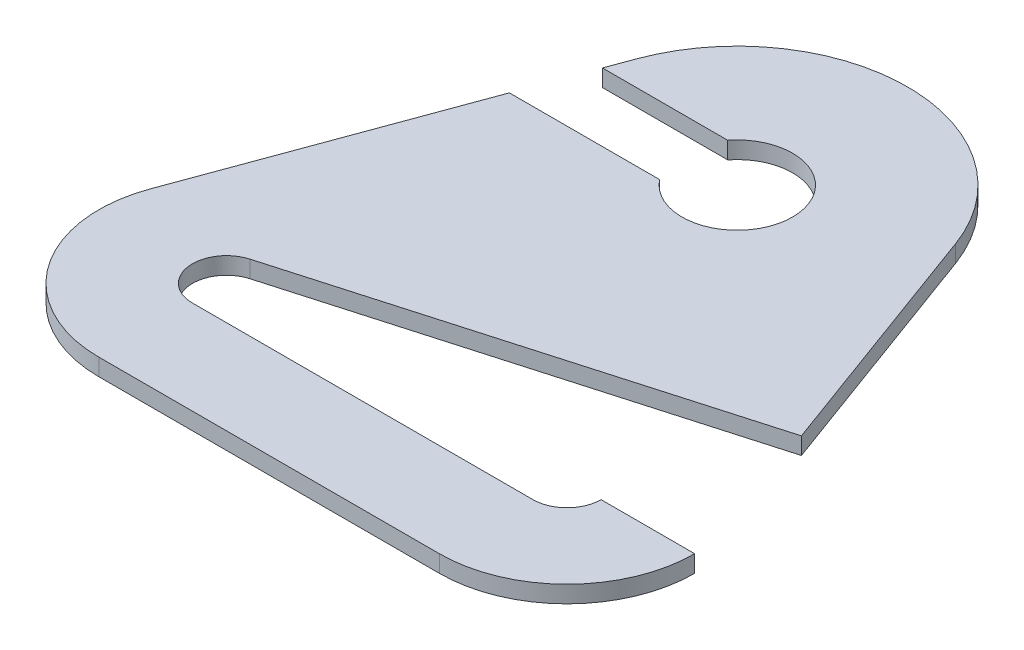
from build123d import *

# Parameters (mm, degrees)
EXTRUDE1_DEPTH = 2


with BuildPart() as part:
    # Sketch1 → Extrude1 (new body)
    with BuildSketch(Plane(origin=(0, 0, 0), x_dir=(1, 0, 0), z_dir=(0, 1, 0))):
        with BuildLine():
            Line((-2.770767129, 36), (-14.082291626, 5.166145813))
            ThreePointArc((-14.082291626, 5.166145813), (-12.298215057, -8.588009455), (0, -15))
            Line((0, -15), (40, -15))
            ThreePointArc((40, -15), (50.606601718, -10.606601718), (55, 0))
            Line((55, 0), (44, 0))
            ThreePointArc((44, 0), (42.828427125, -2.828427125), (40, -4))
            Line((40, -4), (0, -4))
            ThreePointArc((0, -4), (-3.961256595, -0.555379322), (-1.1, 3.845776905))
            Line((-1.1, 3.845776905), (49.280247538, 18.255939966))
            Line((49.280247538, 18.255939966), (38.776388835, 46.888194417))
            ThreePointArc((38.776388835, 46.888194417), (20, 60), (1.223611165, 46.888194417))
            Line((1.223611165, 46.888194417), (0.164065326, 44))
            Line((0.164065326, 44), (14.876524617, 44))
            ThreePointArc((14.876524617, 44), (26.5, 40), (14.876524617, 36))
            Line((14.876524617, 36), (-2.770767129, 36))
        make_face()
    extrude(amount=EXTRUDE1_DEPTH)


solid = part.part
